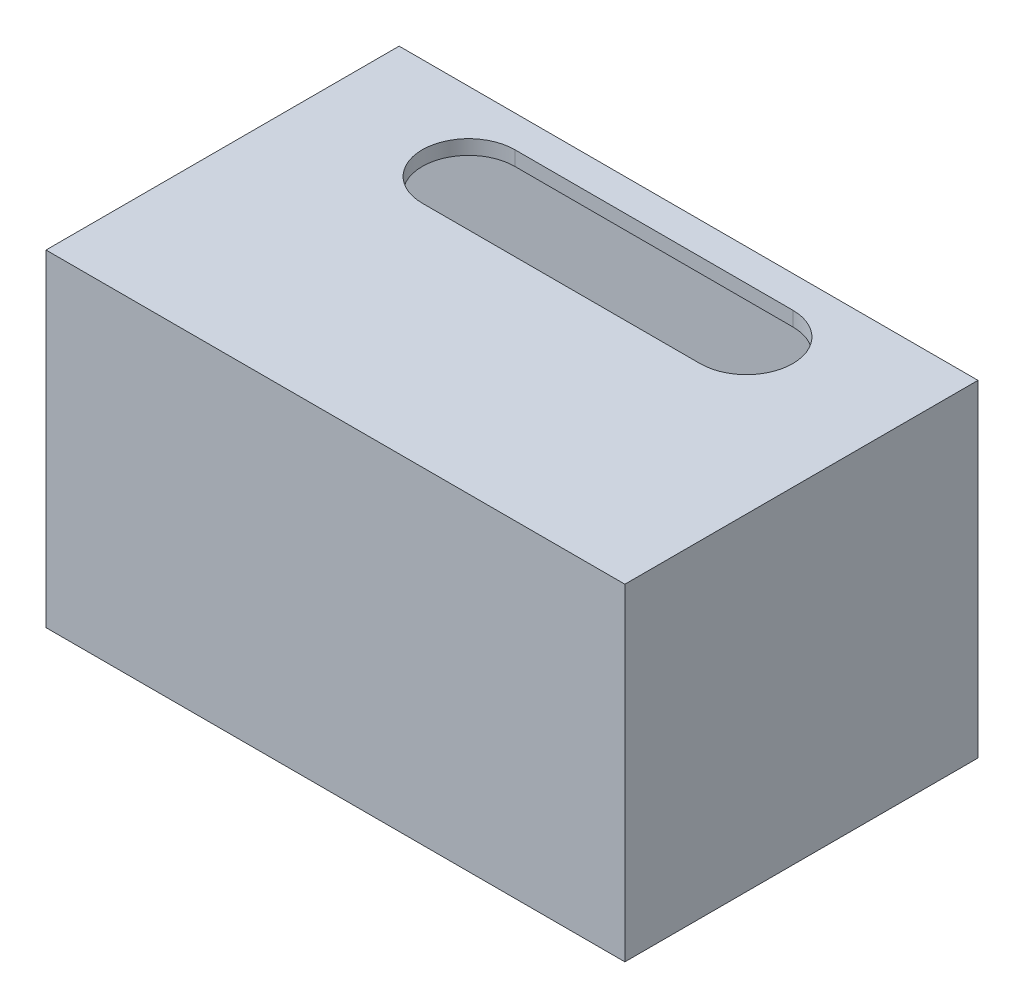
ISO-10303-21;
HEADER;
FILE_DESCRIPTION(('STEP AP214'),'2;1');
FILE_NAME('part.step','',(''),(''),'','','');
FILE_SCHEMA(('AUTOMOTIVE_DESIGN { 1 0 10303 214 1 1 1 1 }'));
ENDSEC;
DATA;
#1=APPLICATION_CONTEXT('core data for automotive mechanical design processes');
#2=APPLICATION_PROTOCOL_DEFINITION('international standard','automotive_design',2000,#1);
#3=PRODUCT_CONTEXT('',#1,'mechanical');
#4=PRODUCT('Part','Part','',(#3));
#5=PRODUCT_RELATED_PRODUCT_CATEGORY('part','',(#4));
#6=PRODUCT_DEFINITION_FORMATION('','',#4);
#7=PRODUCT_DEFINITION_CONTEXT('part definition',#1,'design');
#8=PRODUCT_DEFINITION('design','',#6,#7);
#9=PRODUCT_DEFINITION_SHAPE('','',#8);
#10=(LENGTH_UNIT() NAMED_UNIT(*) SI_UNIT(.MILLI.,.METRE.));
#11=(NAMED_UNIT(*) PLANE_ANGLE_UNIT() SI_UNIT($,.RADIAN.));
#12=(NAMED_UNIT(*) SI_UNIT($,.STERADIAN.) SOLID_ANGLE_UNIT());
#13=UNCERTAINTY_MEASURE_WITH_UNIT(LENGTH_MEASURE(1.E-05),#10,'distance_accuracy_value','');
#14=(GEOMETRIC_REPRESENTATION_CONTEXT(3) GLOBAL_UNCERTAINTY_ASSIGNED_CONTEXT((#13)) GLOBAL_UNIT_ASSIGNED_CONTEXT((#10,
#11,#12)) REPRESENTATION_CONTEXT('',''));
#15=CARTESIAN_POINT('',(0.,0.,0.));
#16=DIRECTION('',(0.,0.,1.));
#17=DIRECTION('',(1.,0.,0.));
#18=AXIS2_PLACEMENT_3D('',#15,#16,#17);
#19=CARTESIAN_POINT('',(0.,4.7625,0.));
#20=DIRECTION('',(1.,0.,0.));
#21=DIRECTION('',(0.,0.,-1.));
#22=AXIS2_PLACEMENT_3D('',#19,#20,#21);
#23=PLANE('',#22);
#24=CARTESIAN_POINT('',(0.,2.38125,-29.21));
#25=DIRECTION('',(-1.,0.,0.));
#26=DIRECTION('',(0.,0.,1.));
#27=AXIS2_PLACEMENT_3D('',#24,#25,#26);
#28=CIRCLE('',#27,1.7272);
#29=CARTESIAN_POINT('',(0.,2.38125,-27.4828));
#30=VERTEX_POINT('',#29);
#31=EDGE_CURVE('E158',#30,#30,#28,.T.);
#32=ORIENTED_EDGE('',*,*,#31,.F.);
#33=EDGE_LOOP('',(#32));
#34=FACE_BOUND('',#33,.T.);
#35=DIRECTION('',(0.,0.,1.));
#36=VECTOR('',#35,1.);
#37=CARTESIAN_POINT('',(0.,0.,0.));
#38=LINE('',#37,#36);
#39=CARTESIAN_POINT('',(0.,0.,-38.735));
#40=VERTEX_POINT('',#39);
#41=CARTESIAN_POINT('',(0.,0.,0.));
#42=VERTEX_POINT('',#41);
#43=EDGE_CURVE('E237',#40,#42,#38,.T.);
#44=ORIENTED_EDGE('',*,*,#43,.T.);
#45=DIRECTION('',(0.,-1.,0.));
#46=VECTOR('',#45,1.);
#47=CARTESIAN_POINT('',(0.,4.7625,0.));
#48=LINE('',#47,#46);
#49=CARTESIAN_POINT('',(0.,35.8775,0.));
#50=VERTEX_POINT('',#49);
#51=EDGE_CURVE('E12',#50,#42,#48,.T.);
#52=ORIENTED_EDGE('',*,*,#51,.F.);
#53=DIRECTION('',(0.,0.,1.));
#54=VECTOR('',#53,1.);
#55=CARTESIAN_POINT('',(0.,35.8775,-38.735));
#56=LINE('',#55,#54);
#57=CARTESIAN_POINT('',(0.,35.8775,-38.735));
#58=VERTEX_POINT('',#57);
#59=EDGE_CURVE('E200',#58,#50,#56,.T.);
#60=ORIENTED_EDGE('',*,*,#59,.F.);
#61=DIRECTION('',(0.,-1.,0.));
#62=VECTOR('',#61,1.);
#63=CARTESIAN_POINT('',(0.,4.7625,-38.735));
#64=LINE('',#63,#62);
#65=EDGE_CURVE('E245',#58,#40,#64,.T.);
#66=ORIENTED_EDGE('',*,*,#65,.T.);
#67=EDGE_LOOP('',(#44,#52,#60,#66));
#68=FACE_BOUND('',#67,.T.);
#69=ADVANCED_FACE('F57',(#34,#68),#23,.F.);
#70=CARTESIAN_POINT('',(0.,4.7625,0.));
#71=DIRECTION('',(0.,0.,-1.));
#72=DIRECTION('',(-1.,0.,0.));
#73=AXIS2_PLACEMENT_3D('',#70,#71,#72);
#74=PLANE('',#73);
#75=DIRECTION('',(1.,0.,0.));
#76=VECTOR('',#75,1.);
#77=CARTESIAN_POINT('',(0.,0.,0.));
#78=LINE('',#77,#76);
#79=CARTESIAN_POINT('',(63.5,0.,0.));
#80=VERTEX_POINT('',#79);
#81=EDGE_CURVE('E240',#42,#80,#78,.T.);
#82=ORIENTED_EDGE('',*,*,#81,.T.);
#83=DIRECTION('',(0.,-1.,0.));
#84=VECTOR('',#83,1.);
#85=CARTESIAN_POINT('',(63.5,4.7625,0.));
#86=LINE('',#85,#84);
#87=CARTESIAN_POINT('',(63.5,35.8775,0.));
#88=VERTEX_POINT('',#87);
#89=EDGE_CURVE('E64',#88,#80,#86,.T.);
#90=ORIENTED_EDGE('',*,*,#89,.F.);
#91=DIRECTION('',(1.,0.,0.));
#92=VECTOR('',#91,1.);
#93=CARTESIAN_POINT('',(63.5,35.8775,0.));
#94=LINE('',#93,#92);
#95=EDGE_CURVE('E203',#50,#88,#94,.T.);
#96=ORIENTED_EDGE('',*,*,#95,.F.);
#97=ORIENTED_EDGE('',*,*,#51,.T.);
#98=EDGE_LOOP('',(#82,#90,#96,#97));
#99=FACE_BOUND('',#98,.T.);
#100=ADVANCED_FACE('F265',(#99),#74,.F.);
#101=CARTESIAN_POINT('',(63.5,4.7625,0.));
#102=DIRECTION('',(-1.,0.,0.));
#103=DIRECTION('',(0.,0.,1.));
#104=AXIS2_PLACEMENT_3D('',#101,#102,#103);
#105=PLANE('',#104);
#106=DIRECTION('',(0.,0.,-1.));
#107=VECTOR('',#106,1.);
#108=CARTESIAN_POINT('',(63.5,0.,0.));
#109=LINE('',#108,#107);
#110=CARTESIAN_POINT('',(63.5,0.,-38.735));
#111=VERTEX_POINT('',#110);
#112=EDGE_CURVE('E242',#80,#111,#109,.T.);
#113=ORIENTED_EDGE('',*,*,#112,.T.);
#114=DIRECTION('',(0.,-1.,0.));
#115=VECTOR('',#114,1.);
#116=CARTESIAN_POINT('',(63.5,4.7625,-38.735));
#117=LINE('',#116,#115);
#118=CARTESIAN_POINT('',(63.5,35.8775,-38.735));
#119=VERTEX_POINT('',#118);
#120=EDGE_CURVE('E247',#119,#111,#117,.T.);
#121=ORIENTED_EDGE('',*,*,#120,.F.);
#122=DIRECTION('',(0.,0.,-1.));
#123=VECTOR('',#122,1.);
#124=CARTESIAN_POINT('',(63.5,35.8775,-38.735));
#125=LINE('',#124,#123);
#126=EDGE_CURVE('E194',#88,#119,#125,.T.);
#127=ORIENTED_EDGE('',*,*,#126,.F.);
#128=ORIENTED_EDGE('',*,*,#89,.T.);
#129=EDGE_LOOP('',(#113,#121,#127,#128));
#130=FACE_BOUND('',#129,.T.);
#131=ADVANCED_FACE('F252',(#130),#105,.F.);
#132=CARTESIAN_POINT('',(0.,4.7625,-38.735));
#133=DIRECTION('',(0.,0.,1.));
#134=DIRECTION('',(1.,0.,0.));
#135=AXIS2_PLACEMENT_3D('',#132,#133,#134);
#136=PLANE('',#135);
#137=DIRECTION('',(-1.,0.,0.));
#138=VECTOR('',#137,1.);
#139=CARTESIAN_POINT('',(0.,0.,-38.735));
#140=LINE('',#139,#138);
#141=EDGE_CURVE('E79',#111,#40,#140,.T.);
#142=ORIENTED_EDGE('',*,*,#141,.T.);
#143=ORIENTED_EDGE('',*,*,#65,.F.);
#144=DIRECTION('',(-1.,0.,0.));
#145=VECTOR('',#144,1.);
#146=CARTESIAN_POINT('',(63.5,35.8775,-38.735));
#147=LINE('',#146,#145);
#148=EDGE_CURVE('E197',#119,#58,#147,.T.);
#149=ORIENTED_EDGE('',*,*,#148,.F.);
#150=ORIENTED_EDGE('',*,*,#120,.T.);
#151=EDGE_LOOP('',(#142,#143,#149,#150));
#152=FACE_BOUND('',#151,.T.);
#153=ADVANCED_FACE('F261',(#152),#136,.F.);
#154=CARTESIAN_POINT('',(0.,0.,-38.735));
#155=DIRECTION('',(0.,-1.,0.));
#156=DIRECTION('',(0.,0.,-1.));
#157=AXIS2_PLACEMENT_3D('',#154,#155,#156);
#158=PLANE('',#157);
#159=ORIENTED_EDGE('',*,*,#43,.F.);
#160=ORIENTED_EDGE('',*,*,#141,.F.);
#161=ORIENTED_EDGE('',*,*,#112,.F.);
#162=ORIENTED_EDGE('',*,*,#81,.F.);
#163=EDGE_LOOP('',(#159,#160,#161,#162));
#164=FACE_BOUND('',#163,.T.);
#165=ADVANCED_FACE('F257',(#164),#158,.T.);
#166=CARTESIAN_POINT('',(63.5,35.8775,0.));
#167=DIRECTION('',(0.,-1.,0.));
#168=DIRECTION('',(0.,0.,-1.));
#169=AXIS2_PLACEMENT_3D('',#166,#167,#168);
#170=PLANE('',#169);
#171=ORIENTED_EDGE('',*,*,#126,.T.);
#172=ORIENTED_EDGE('',*,*,#148,.T.);
#173=ORIENTED_EDGE('',*,*,#59,.T.);
#174=ORIENTED_EDGE('',*,*,#95,.T.);
#175=EDGE_LOOP('',(#171,#172,#173,#174));
#176=FACE_BOUND('',#175,.T.);
#177=CARTESIAN_POINT('',(16.1925,35.8775,-30.1625));
#178=DIRECTION('',(0.,1.,0.));
#179=DIRECTION('',(0.,0.,1.));
#180=AXIS2_PLACEMENT_3D('',#177,#178,#179);
#181=CIRCLE('',#180,5.08);
#182=CARTESIAN_POINT('',(16.1925,35.8775,-35.2425));
#183=VERTEX_POINT('',#182);
#184=CARTESIAN_POINT('',(16.1925,35.8775,-25.0825));
#185=VERTEX_POINT('',#184);
#186=EDGE_CURVE('E164',#183,#185,#181,.T.);
#187=ORIENTED_EDGE('',*,*,#186,.F.);
#188=DIRECTION('',(-1.,0.,0.));
#189=VECTOR('',#188,1.);
#190=CARTESIAN_POINT('',(16.1925,35.8775,-35.2425));
#191=LINE('',#190,#189);
#192=CARTESIAN_POINT('',(46.6725,35.8775,-35.2425));
#193=VERTEX_POINT('',#192);
#194=EDGE_CURVE('E172',#193,#183,#191,.T.);
#195=ORIENTED_EDGE('',*,*,#194,.F.);
#196=CARTESIAN_POINT('',(46.6725,35.8775,-30.1625));
#197=DIRECTION('',(0.,1.,0.));
#198=DIRECTION('',(0.,0.,1.));
#199=AXIS2_PLACEMENT_3D('',#196,#197,#198);
#200=CIRCLE('',#199,5.08);
#201=CARTESIAN_POINT('',(46.6725,35.8775,-25.0825));
#202=VERTEX_POINT('',#201);
#203=EDGE_CURVE('E169',#202,#193,#200,.T.);
#204=ORIENTED_EDGE('',*,*,#203,.F.);
#205=DIRECTION('',(1.,0.,0.));
#206=VECTOR('',#205,1.);
#207=CARTESIAN_POINT('',(46.6725,35.8775,-25.0825));
#208=LINE('',#207,#206);
#209=EDGE_CURVE('E166',#185,#202,#208,.T.);
#210=ORIENTED_EDGE('',*,*,#209,.F.);
#211=EDGE_LOOP('',(#187,#195,#204,#210));
#212=FACE_BOUND('',#211,.T.);
#213=ADVANCED_FACE('F263',(#176,#212),#170,.F.);
#214=CARTESIAN_POINT('',(63.5,34.29,0.));
#215=DIRECTION('',(0.,-1.,0.));
#216=DIRECTION('',(0.,0.,-1.));
#217=AXIS2_PLACEMENT_3D('',#214,#215,#216);
#218=PLANE('',#217);
#219=DIRECTION('',(1.,0.,0.));
#220=VECTOR('',#219,1.);
#221=CARTESIAN_POINT('',(0.,34.29,-1.5875));
#222=LINE('',#221,#220);
#223=CARTESIAN_POINT('',(1.5875,34.29,-1.5875));
#224=VERTEX_POINT('',#223);
#225=CARTESIAN_POINT('',(61.9125,34.29,-1.5875));
#226=VERTEX_POINT('',#225);
#227=EDGE_CURVE('E210',#224,#226,#222,.T.);
#228=ORIENTED_EDGE('',*,*,#227,.F.);
#229=DIRECTION('',(0.,0.,1.));
#230=VECTOR('',#229,1.);
#231=CARTESIAN_POINT('',(1.5875,34.29,-38.735));
#232=LINE('',#231,#230);
#233=CARTESIAN_POINT('',(1.5875,34.29,-37.1475));
#234=VERTEX_POINT('',#233);
#235=EDGE_CURVE('E207',#234,#224,#232,.T.);
#236=ORIENTED_EDGE('',*,*,#235,.F.);
#237=DIRECTION('',(-1.,0.,0.));
#238=VECTOR('',#237,1.);
#239=CARTESIAN_POINT('',(0.,34.29,-37.1475));
#240=LINE('',#239,#238);
#241=CARTESIAN_POINT('',(61.9125,34.29,-37.1475));
#242=VERTEX_POINT('',#241);
#243=EDGE_CURVE('E217',#242,#234,#240,.T.);
#244=ORIENTED_EDGE('',*,*,#243,.F.);
#245=DIRECTION('',(0.,0.,-1.));
#246=VECTOR('',#245,1.);
#247=CARTESIAN_POINT('',(61.9125,34.29,-38.735));
#248=LINE('',#247,#246);
#249=EDGE_CURVE('E214',#226,#242,#248,.T.);
#250=ORIENTED_EDGE('',*,*,#249,.F.);
#251=EDGE_LOOP('',(#228,#236,#244,#250));
#252=FACE_BOUND('',#251,.T.);
#253=DIRECTION('',(-1.,0.,0.));
#254=VECTOR('',#253,1.);
#255=CARTESIAN_POINT('',(16.1925,34.29,-35.2425));
#256=LINE('',#255,#254);
#257=CARTESIAN_POINT('',(46.6725,34.29,-35.2425));
#258=VERTEX_POINT('',#257);
#259=CARTESIAN_POINT('',(16.1925,34.29,-35.2425));
#260=VERTEX_POINT('',#259);
#261=EDGE_CURVE('E167',#258,#260,#256,.T.);
#262=ORIENTED_EDGE('',*,*,#261,.T.);
#263=CARTESIAN_POINT('',(16.1925,34.29,-30.1625));
#264=DIRECTION('',(0.,1.,0.));
#265=DIRECTION('',(0.,0.,1.));
#266=AXIS2_PLACEMENT_3D('',#263,#264,#265);
#267=CIRCLE('',#266,5.08);
#268=CARTESIAN_POINT('',(16.1925,34.29,-25.0825));
#269=VERTEX_POINT('',#268);
#270=EDGE_CURVE('E161',#260,#269,#267,.T.);
#271=ORIENTED_EDGE('',*,*,#270,.T.);
#272=DIRECTION('',(1.,0.,0.));
#273=VECTOR('',#272,1.);
#274=CARTESIAN_POINT('',(46.6725,34.29,-25.0825));
#275=LINE('',#274,#273);
#276=CARTESIAN_POINT('',(46.6725,34.29,-25.0825));
#277=VERTEX_POINT('',#276);
#278=EDGE_CURVE('E177',#269,#277,#275,.T.);
#279=ORIENTED_EDGE('',*,*,#278,.T.);
#280=CARTESIAN_POINT('',(46.6725,34.29,-30.1625));
#281=DIRECTION('',(0.,1.,0.));
#282=DIRECTION('',(0.,0.,1.));
#283=AXIS2_PLACEMENT_3D('',#280,#281,#282);
#284=CIRCLE('',#283,5.08);
#285=EDGE_CURVE('E180',#277,#258,#284,.T.);
#286=ORIENTED_EDGE('',*,*,#285,.T.);
#287=EDGE_LOOP('',(#262,#271,#279,#286));
#288=FACE_BOUND('',#287,.T.);
#289=ADVANCED_FACE('F298',(#252,#288),#218,.T.);
#290=CARTESIAN_POINT('',(16.1925,35.8775,-30.1625));
#291=DIRECTION('',(0.,-1.,0.));
#292=DIRECTION('',(0.,0.,-1.));
#293=AXIS2_PLACEMENT_3D('',#290,#291,#292);
#294=CYLINDRICAL_SURFACE('',#293,5.08);
#295=ORIENTED_EDGE('',*,*,#270,.F.);
#296=DIRECTION('',(0.,-1.,0.));
#297=VECTOR('',#296,1.);
#298=CARTESIAN_POINT('',(16.1925,35.8775,-35.2425));
#299=LINE('',#298,#297);
#300=EDGE_CURVE('E174',#183,#260,#299,.T.);
#301=ORIENTED_EDGE('',*,*,#300,.F.);
#302=ORIENTED_EDGE('',*,*,#186,.T.);
#303=DIRECTION('',(0.,-1.,0.));
#304=VECTOR('',#303,1.);
#305=CARTESIAN_POINT('',(16.1925,35.8775,-25.0825));
#306=LINE('',#305,#304);
#307=EDGE_CURVE('E191',#185,#269,#306,.T.);
#308=ORIENTED_EDGE('',*,*,#307,.T.);
#309=EDGE_LOOP('',(#295,#301,#302,#308));
#310=FACE_BOUND('',#309,.T.);
#311=ADVANCED_FACE('F301',(#310),#294,.F.);
#312=CARTESIAN_POINT('',(46.6725,35.8775,-25.0825));
#313=DIRECTION('',(0.,0.,-1.));
#314=DIRECTION('',(-1.,0.,0.));
#315=AXIS2_PLACEMENT_3D('',#312,#313,#314);
#316=PLANE('',#315);
#317=ORIENTED_EDGE('',*,*,#278,.F.);
#318=ORIENTED_EDGE('',*,*,#307,.F.);
#319=ORIENTED_EDGE('',*,*,#209,.T.);
#320=DIRECTION('',(0.,-1.,0.));
#321=VECTOR('',#320,1.);
#322=CARTESIAN_POINT('',(46.6725,35.8775,-25.0825));
#323=LINE('',#322,#321);
#324=EDGE_CURVE('E189',#202,#277,#323,.T.);
#325=ORIENTED_EDGE('',*,*,#324,.T.);
#326=EDGE_LOOP('',(#317,#318,#319,#325));
#327=FACE_BOUND('',#326,.T.);
#328=ADVANCED_FACE('F307',(#327),#316,.T.);
#329=CARTESIAN_POINT('',(46.6725,35.8775,-30.1625));
#330=DIRECTION('',(0.,-1.,0.));
#331=DIRECTION('',(0.,0.,-1.));
#332=AXIS2_PLACEMENT_3D('',#329,#330,#331);
#333=CYLINDRICAL_SURFACE('',#332,5.08);
#334=ORIENTED_EDGE('',*,*,#285,.F.);
#335=ORIENTED_EDGE('',*,*,#324,.F.);
#336=ORIENTED_EDGE('',*,*,#203,.T.);
#337=DIRECTION('',(0.,-1.,0.));
#338=VECTOR('',#337,1.);
#339=CARTESIAN_POINT('',(46.6725,35.8775,-35.2425));
#340=LINE('',#339,#338);
#341=EDGE_CURVE('E187',#193,#258,#340,.T.);
#342=ORIENTED_EDGE('',*,*,#341,.T.);
#343=EDGE_LOOP('',(#334,#335,#336,#342));
#344=FACE_BOUND('',#343,.T.);
#345=ADVANCED_FACE('F311',(#344),#333,.F.);
#346=CARTESIAN_POINT('',(16.1925,35.8775,-35.2425));
#347=DIRECTION('',(0.,0.,1.));
#348=DIRECTION('',(1.,0.,0.));
#349=AXIS2_PLACEMENT_3D('',#346,#347,#348);
#350=PLANE('',#349);
#351=ORIENTED_EDGE('',*,*,#261,.F.);
#352=ORIENTED_EDGE('',*,*,#341,.F.);
#353=ORIENTED_EDGE('',*,*,#194,.T.);
#354=ORIENTED_EDGE('',*,*,#300,.T.);
#355=EDGE_LOOP('',(#351,#352,#353,#354));
#356=FACE_BOUND('',#355,.T.);
#357=ADVANCED_FACE('F282',(#356),#350,.T.);
#358=CARTESIAN_POINT('',(0.,4.7625,-38.735));
#359=DIRECTION('',(0.,-1.,0.));
#360=DIRECTION('',(0.,0.,-1.));
#361=AXIS2_PLACEMENT_3D('',#358,#359,#360);
#362=PLANE('',#361);
#363=DIRECTION('',(-1.,0.,0.));
#364=VECTOR('',#363,1.);
#365=CARTESIAN_POINT('',(0.,4.7625,-37.1475));
#366=LINE('',#365,#364);
#367=CARTESIAN_POINT('',(61.9125,4.7625,-37.1475));
#368=VERTEX_POINT('',#367);
#369=CARTESIAN_POINT('',(1.5875,4.7625,-37.1475));
#370=VERTEX_POINT('',#369);
#371=EDGE_CURVE('E211',#368,#370,#366,.T.);
#372=ORIENTED_EDGE('',*,*,#371,.T.);
#373=DIRECTION('',(0.,0.,1.));
#374=VECTOR('',#373,1.);
#375=CARTESIAN_POINT('',(1.5875,4.7625,-38.735));
#376=LINE('',#375,#374);
#377=CARTESIAN_POINT('',(1.5875,4.7625,-1.5875));
#378=VERTEX_POINT('',#377);
#379=EDGE_CURVE('E206',#370,#378,#376,.T.);
#380=ORIENTED_EDGE('',*,*,#379,.T.);
#381=DIRECTION('',(1.,0.,0.));
#382=VECTOR('',#381,1.);
#383=CARTESIAN_POINT('',(0.,4.7625,-1.5875));
#384=LINE('',#383,#382);
#385=CARTESIAN_POINT('',(61.9125,4.7625,-1.5875));
#386=VERTEX_POINT('',#385);
#387=EDGE_CURVE('E221',#378,#386,#384,.T.);
#388=ORIENTED_EDGE('',*,*,#387,.T.);
#389=DIRECTION('',(0.,0.,-1.));
#390=VECTOR('',#389,1.);
#391=CARTESIAN_POINT('',(61.9125,4.7625,-38.735));
#392=LINE('',#391,#390);
#393=EDGE_CURVE('E224',#386,#368,#392,.T.);
#394=ORIENTED_EDGE('',*,*,#393,.T.);
#395=EDGE_LOOP('',(#372,#380,#388,#394));
#396=FACE_BOUND('',#395,.T.);
#397=ADVANCED_FACE('F278',(#396),#362,.F.);
#398=CARTESIAN_POINT('',(0.,34.29,-37.1475));
#399=DIRECTION('',(0.,0.,1.));
#400=DIRECTION('',(1.,0.,0.));
#401=AXIS2_PLACEMENT_3D('',#398,#399,#400);
#402=PLANE('',#401);
#403=ORIENTED_EDGE('',*,*,#371,.F.);
#404=DIRECTION('',(0.,-1.,0.));
#405=VECTOR('',#404,1.);
#406=CARTESIAN_POINT('',(61.9125,34.29,-37.1475));
#407=LINE('',#406,#405);
#408=EDGE_CURVE('E230',#242,#368,#407,.T.);
#409=ORIENTED_EDGE('',*,*,#408,.F.);
#410=ORIENTED_EDGE('',*,*,#243,.T.);
#411=DIRECTION('',(0.,-1.,0.));
#412=VECTOR('',#411,1.);
#413=CARTESIAN_POINT('',(1.5875,34.29,-37.1475));
#414=LINE('',#413,#412);
#415=EDGE_CURVE('E71',#234,#370,#414,.T.);
#416=ORIENTED_EDGE('',*,*,#415,.T.);
#417=EDGE_LOOP('',(#403,#409,#410,#416));
#418=FACE_BOUND('',#417,.T.);
#419=ADVANCED_FACE('F281',(#418),#402,.T.);
#420=CARTESIAN_POINT('',(61.9125,34.29,-38.735));
#421=DIRECTION('',(-1.,0.,0.));
#422=DIRECTION('',(0.,0.,1.));
#423=AXIS2_PLACEMENT_3D('',#420,#421,#422);
#424=PLANE('',#423);
#425=ORIENTED_EDGE('',*,*,#393,.F.);
#426=DIRECTION('',(0.,-1.,0.));
#427=VECTOR('',#426,1.);
#428=CARTESIAN_POINT('',(61.9125,34.29,-1.5875));
#429=LINE('',#428,#427);
#430=EDGE_CURVE('E232',#226,#386,#429,.T.);
#431=ORIENTED_EDGE('',*,*,#430,.F.);
#432=ORIENTED_EDGE('',*,*,#249,.T.);
#433=ORIENTED_EDGE('',*,*,#408,.T.);
#434=EDGE_LOOP('',(#425,#431,#432,#433));
#435=FACE_BOUND('',#434,.T.);
#436=ADVANCED_FACE('F291',(#435),#424,.T.);
#437=CARTESIAN_POINT('',(0.,34.29,-1.5875));
#438=DIRECTION('',(0.,0.,-1.));
#439=DIRECTION('',(-1.,0.,0.));
#440=AXIS2_PLACEMENT_3D('',#437,#438,#439);
#441=PLANE('',#440);
#442=ORIENTED_EDGE('',*,*,#387,.F.);
#443=DIRECTION('',(0.,-1.,0.));
#444=VECTOR('',#443,1.);
#445=CARTESIAN_POINT('',(1.5875,34.29,-1.5875));
#446=LINE('',#445,#444);
#447=EDGE_CURVE('E234',#224,#378,#446,.T.);
#448=ORIENTED_EDGE('',*,*,#447,.F.);
#449=ORIENTED_EDGE('',*,*,#227,.T.);
#450=ORIENTED_EDGE('',*,*,#430,.T.);
#451=EDGE_LOOP('',(#442,#448,#449,#450));
#452=FACE_BOUND('',#451,.T.);
#453=ADVANCED_FACE('F287',(#452),#441,.T.);
#454=CARTESIAN_POINT('',(1.5875,34.29,-38.735));
#455=DIRECTION('',(1.,0.,0.));
#456=DIRECTION('',(0.,0.,-1.));
#457=AXIS2_PLACEMENT_3D('',#454,#455,#456);
#458=PLANE('',#457);
#459=ORIENTED_EDGE('',*,*,#379,.F.);
#460=ORIENTED_EDGE('',*,*,#415,.F.);
#461=ORIENTED_EDGE('',*,*,#235,.T.);
#462=ORIENTED_EDGE('',*,*,#447,.T.);
#463=EDGE_LOOP('',(#459,#460,#461,#462));
#464=FACE_BOUND('',#463,.T.);
#465=ADVANCED_FACE('F284',(#464),#458,.T.);
#466=CARTESIAN_POINT('',(0.,2.38125,-29.21));
#467=DIRECTION('',(-1.,0.,0.));
#468=DIRECTION('',(0.,0.,1.));
#469=AXIS2_PLACEMENT_3D('',#466,#467,#468);
#470=CYLINDRICAL_SURFACE('',#469,1.7272);
#471=CARTESIAN_POINT('',(12.446,2.38125,-29.21));
#472=DIRECTION('',(-1.,0.,0.));
#473=DIRECTION('',(0.,0.,1.));
#474=AXIS2_PLACEMENT_3D('',#471,#472,#473);
#475=CIRCLE('',#474,1.7272);
#476=CARTESIAN_POINT('',(12.446,2.38125,-27.4828));
#477=VERTEX_POINT('',#476);
#478=EDGE_CURVE('E156',#477,#477,#475,.T.);
#479=ORIENTED_EDGE('',*,*,#478,.F.);
#480=EDGE_LOOP('',(#479));
#481=FACE_BOUND('',#480,.T.);
#482=ORIENTED_EDGE('',*,*,#31,.T.);
#483=EDGE_LOOP('',(#482));
#484=FACE_BOUND('',#483,.T.);
#485=ADVANCED_FACE('F152',(#481,#484),#470,.F.);
#486=CARTESIAN_POINT('',(12.446,2.38125,-29.21));
#487=DIRECTION('',(-1.,0.,0.));
#488=DIRECTION('',(0.,0.,1.));
#489=AXIS2_PLACEMENT_3D('',#486,#487,#488);
#490=CONICAL_SURFACE('',#489,1.7272,1.02974425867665);
#491=CARTESIAN_POINT('',(13.4838064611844,2.38124999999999,-29.21));
#492=VERTEX_POINT('',#491);
#493=VERTEX_LOOP('',#492);
#494=FACE_BOUND('',#493,.T.);
#495=ORIENTED_EDGE('',*,*,#478,.T.);
#496=EDGE_LOOP('',(#495));
#497=FACE_BOUND('',#496,.T.);
#498=ADVANCED_FACE('F149',(#494,#497),#490,.F.);
#499=CLOSED_SHELL('',(#69,#100,#131,#153,#165,#213,#289,#311,#328,#345,#357,#397,#419,#436,#453,
#465,#485,#498));
#500=MANIFOLD_SOLID_BREP('B2',#499);
#501=ADVANCED_BREP_SHAPE_REPRESENTATION('',(#18,#500),#14);
#502=SHAPE_DEFINITION_REPRESENTATION(#9,#501);
ENDSEC;
END-ISO-10303-21;
